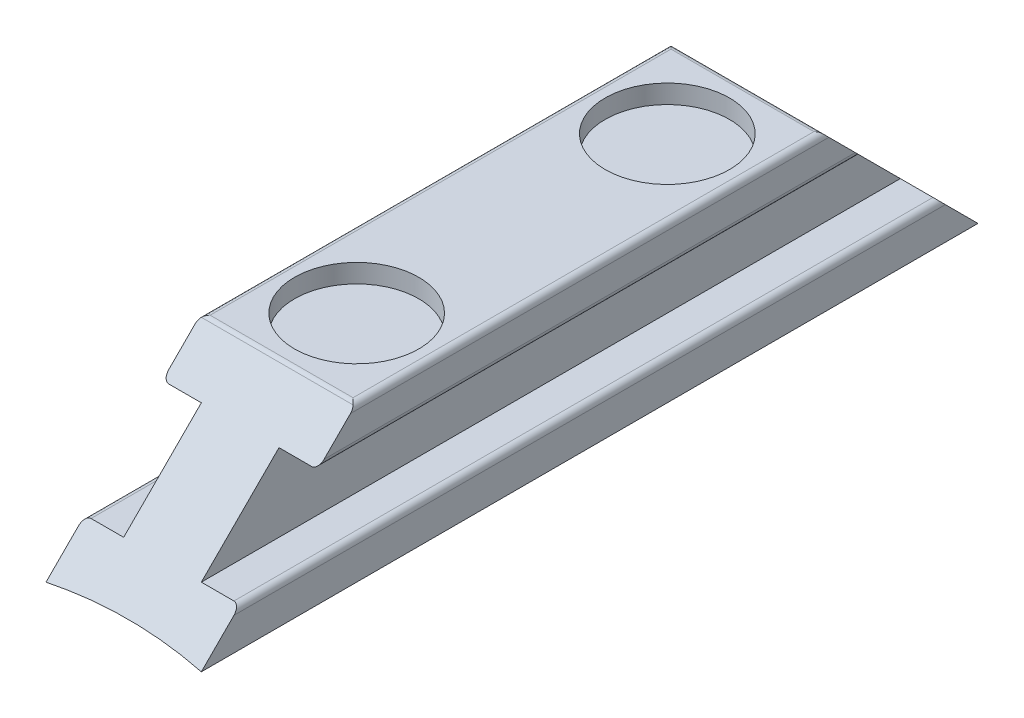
from build123d import *

# Parameters (mm, degrees)
EXTRUDE1_DEPTH     = 31.75
SKETCH2_OUTSIDE_W  = 40.35
SKETCH2_OUTSIDE_H  = 14.95
CUT_EXTRUDE1_DEPTH = 101.6
SKETCH5_R          = 27.78125
CUT_EXTRUDE3_DEPTH = 101.6
FILLET1_R          = 0.254
SKETCH6_R          = 2.54
CUT_EXTRUDE4_DEPTH = 0.762


with BuildPart() as part:
    # Sketch1 → Extrude1 (new body)
    with BuildSketch(Plane.XY):
        Polygon((-14.093746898, 0), (-14.093746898, 6.35), (-17.268746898, 6.35), (-17.268746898, 4.7625), (-15.681246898, 4.7625), (-15.681246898, 1.5875), (-17.268746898, 1.5875), (-17.268746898, 0), align=None)
        Polygon((-10.918746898, 6.35), (-14.093746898, 6.35), (-14.093746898, 0), (-10.918746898, 0), (-10.918746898, 1.5875), (-12.506246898, 1.5875), (-12.506246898, 4.7625), (-10.918746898, 4.7625), align=None)
    extrude(amount=EXTRUDE1_DEPTH)

    # Sketch2 outside → Cut-Extrude1 (cut)
    with BuildSketch(Plane.ZY.offset(17.268746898)):
        with Locations((15.875, 3.175)):
            Rectangle(SKETCH2_OUTSIDE_W, SKETCH2_OUTSIDE_H)
        Polygon((0, 0), (6.35, 6.35), (25.4, 6.35), (31.75, 0), align=None, mode=Mode.SUBTRACT)
    extrude(amount=-CUT_EXTRUDE1_DEPTH, mode=Mode.SUBTRACT)

    # Sketch5 → Cut-Extrude3 (cut)
    with BuildSketch(Plane.XY):
        with Locations((-14.093746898, -27.599225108)):
            Circle(SKETCH5_R)
    extrude(amount=CUT_EXTRUDE3_DEPTH, mode=Mode.SUBTRACT)

    # Fillet1
    fillet1_edges = [part.edges().sort_by_distance(p)[0] for p in [
        (-17.268746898, 1.5875, 15.875),
        (-17.268746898, 4.7625, 15.875),
        (-17.268746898, 6.35, 15.875),
        (-10.918746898, 6.35, 15.875),
        (-10.918746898, 4.7625, 15.875),
        (-10.918746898, 1.5875, 15.875),
        (-14.093746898, 6.35, 6.35),
        (-14.093746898, 6.35, 25.4),
    ]]
    fillet(fillet1_edges, radius=FILLET1_R)

    # Sketch6 → Cut-Extrude4 (cut)
    with BuildSketch(Plane(origin=(0, 6.35, 0), x_dir=(-1, 0, 0), z_dir=(0, 1, 0))):
        with Locations(Location((14.093746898, 9.525, 0), (0, 0, 90))):
            Circle(SKETCH6_R)
        with Locations(Location((14.093746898, 22.225, 0), (0, 0, 90))):
            Circle(SKETCH6_R)
    extrude(amount=-CUT_EXTRUDE4_DEPTH, mode=Mode.SUBTRACT)


solid = part.part
